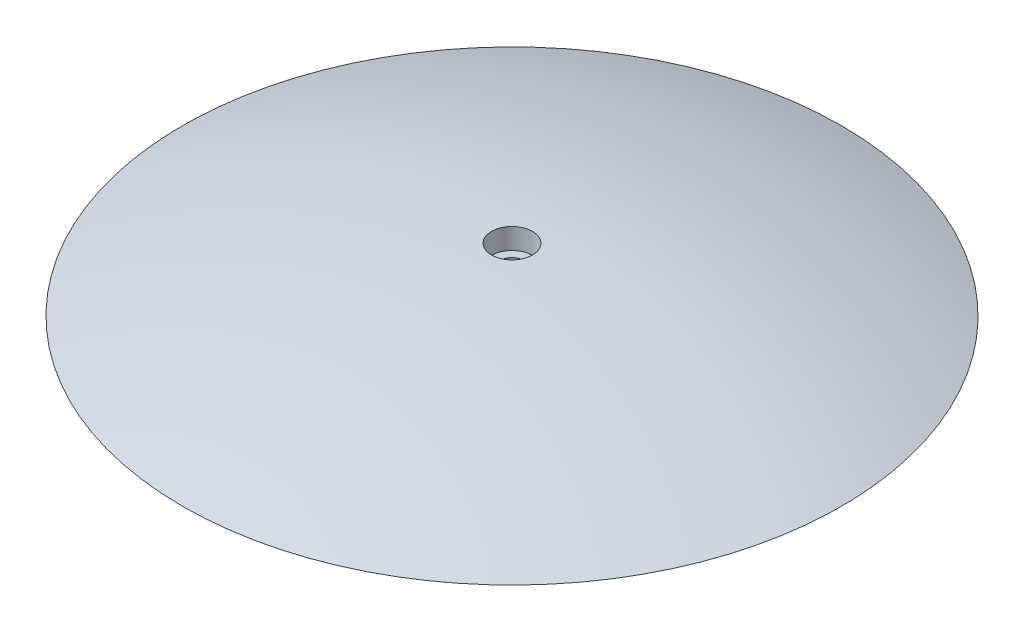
ISO-10303-21;
HEADER;
FILE_DESCRIPTION(('STEP AP214'),'2;1');
FILE_NAME('part.step','',(''),(''),'','','');
FILE_SCHEMA(('AUTOMOTIVE_DESIGN { 1 0 10303 214 1 1 1 1 }'));
ENDSEC;
DATA;
#1=APPLICATION_CONTEXT('core data for automotive mechanical design processes');
#2=APPLICATION_PROTOCOL_DEFINITION('international standard','automotive_design',2000,#1);
#3=PRODUCT_CONTEXT('',#1,'mechanical');
#4=PRODUCT('Part','Part','',(#3));
#5=PRODUCT_RELATED_PRODUCT_CATEGORY('part','',(#4));
#6=PRODUCT_DEFINITION_FORMATION('','',#4);
#7=PRODUCT_DEFINITION_CONTEXT('part definition',#1,'design');
#8=PRODUCT_DEFINITION('design','',#6,#7);
#9=PRODUCT_DEFINITION_SHAPE('','',#8);
#10=(LENGTH_UNIT() NAMED_UNIT(*) SI_UNIT(.MILLI.,.METRE.));
#11=(NAMED_UNIT(*) PLANE_ANGLE_UNIT() SI_UNIT($,.RADIAN.));
#12=(NAMED_UNIT(*) SI_UNIT($,.STERADIAN.) SOLID_ANGLE_UNIT());
#13=UNCERTAINTY_MEASURE_WITH_UNIT(LENGTH_MEASURE(1.E-05),#10,'distance_accuracy_value','');
#14=(GEOMETRIC_REPRESENTATION_CONTEXT(3) GLOBAL_UNCERTAINTY_ASSIGNED_CONTEXT((#13)) GLOBAL_UNIT_ASSIGNED_CONTEXT((#10,
#11,#12)) REPRESENTATION_CONTEXT('',''));
#15=CARTESIAN_POINT('',(0.,0.,0.));
#16=DIRECTION('',(0.,0.,1.));
#17=DIRECTION('',(1.,0.,0.));
#18=AXIS2_PLACEMENT_3D('',#15,#16,#17);
#19=CARTESIAN_POINT('',(0.,-41.2878564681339,0.));
#20=DIRECTION('',(0.,1.,0.));
#21=DIRECTION('',(0.,0.,1.));
#22=AXIS2_PLACEMENT_3D('',#19,#20,#21);
#23=DEGENERATE_TOROIDAL_SURFACE('',#22,0.302242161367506,44.3439990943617,.F.);
#24=CARTESIAN_POINT('',(0.,3.03742922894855,0.));
#25=DIRECTION('',(0.,1.,0.));
#26=DIRECTION('',(0.,0.,1.));
#27=AXIS2_PLACEMENT_3D('',#24,#25,#26);
#28=CIRCLE('',#27,0.985897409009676);
#29=CARTESIAN_POINT('',(0.,3.03742922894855,0.985897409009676));
#30=VERTEX_POINT('',#29);
#31=EDGE_CURVE('E10',#30,#30,#28,.T.);
#32=ORIENTED_EDGE('',*,*,#31,.F.);
#33=EDGE_LOOP('',(#32));
#34=FACE_BOUND('',#33,.T.);
#35=CARTESIAN_POINT('',(0.,0.,0.));
#36=DIRECTION('',(0.,1.,0.));
#37=DIRECTION('',(0.,0.,1.));
#38=AXIS2_PLACEMENT_3D('',#35,#36,#37);
#39=CIRCLE('',#38,15.875);
#40=CARTESIAN_POINT('',(0.,0.,15.875));
#41=VERTEX_POINT('',#40);
#42=EDGE_CURVE('E47',#41,#41,#39,.T.);
#43=ORIENTED_EDGE('',*,*,#42,.T.);
#44=EDGE_LOOP('',(#43));
#45=FACE_BOUND('',#44,.T.);
#46=ADVANCED_FACE('F28',(#34,#45),#23,.F.);
#47=CARTESIAN_POINT('',(0.,33.4003712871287,0.));
#48=DIRECTION('',(0.,1.,0.));
#49=DIRECTION('',(0.,0.,1.));
#50=AXIS2_PLACEMENT_3D('',#47,#48,#49);
#51=CYLINDRICAL_SURFACE('',#50,0.985897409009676);
#52=CARTESIAN_POINT('',(0.,2.03552212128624,0.));
#53=DIRECTION('',(0.,1.,0.));
#54=DIRECTION('',(0.,0.,1.));
#55=AXIS2_PLACEMENT_3D('',#52,#53,#54);
#56=CIRCLE('',#55,0.985897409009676);
#57=CARTESIAN_POINT('',(0.,2.03552212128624,0.985897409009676));
#58=VERTEX_POINT('',#57);
#59=EDGE_CURVE('E34',#58,#58,#56,.T.);
#60=ORIENTED_EDGE('',*,*,#59,.F.);
#61=EDGE_LOOP('',(#60));
#62=FACE_BOUND('',#61,.T.);
#63=ORIENTED_EDGE('',*,*,#31,.T.);
#64=EDGE_LOOP('',(#63));
#65=FACE_BOUND('',#64,.T.);
#66=ADVANCED_FACE('F66',(#62,#65),#51,.F.);
#67=CARTESIAN_POINT('',(0.985897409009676,2.03552212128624,0.));
#68=DIRECTION('',(0.,-1.,0.));
#69=DIRECTION('',(0.,0.,-1.));
#70=AXIS2_PLACEMENT_3D('',#67,#68,#69);
#71=PLANE('',#70);
#72=CARTESIAN_POINT('',(0.,2.03552212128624,0.));
#73=DIRECTION('',(0.,1.,0.));
#74=DIRECTION('',(0.,0.,1.));
#75=AXIS2_PLACEMENT_3D('',#72,#73,#74);
#76=CIRCLE('',#75,0.572486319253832);
#77=CARTESIAN_POINT('',(0.,2.03552212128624,0.572486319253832));
#78=VERTEX_POINT('',#77);
#79=EDGE_CURVE('E38',#78,#78,#76,.T.);
#80=ORIENTED_EDGE('',*,*,#79,.F.);
#81=EDGE_LOOP('',(#80));
#82=FACE_BOUND('',#81,.T.);
#83=ORIENTED_EDGE('',*,*,#59,.T.);
#84=EDGE_LOOP('',(#83));
#85=FACE_BOUND('',#84,.T.);
#86=ADVANCED_FACE('F61',(#82,#85),#71,.F.);
#87=CARTESIAN_POINT('',(0.,33.4003712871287,0.));
#88=DIRECTION('',(0.,1.,0.));
#89=DIRECTION('',(0.,0.,1.));
#90=AXIS2_PLACEMENT_3D('',#87,#88,#89);
#91=CYLINDRICAL_SURFACE('',#90,0.572486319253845);
#92=CARTESIAN_POINT('',(0.,0.,0.));
#93=DIRECTION('',(0.,1.,0.));
#94=DIRECTION('',(0.,0.,1.));
#95=AXIS2_PLACEMENT_3D('',#92,#93,#94);
#96=CIRCLE('',#95,0.572486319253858);
#97=CARTESIAN_POINT('',(0.,0.,0.572486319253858));
#98=VERTEX_POINT('',#97);
#99=EDGE_CURVE('E42',#98,#98,#96,.T.);
#100=ORIENTED_EDGE('',*,*,#99,.F.);
#101=EDGE_LOOP('',(#100));
#102=FACE_BOUND('',#101,.T.);
#103=ORIENTED_EDGE('',*,*,#79,.T.);
#104=EDGE_LOOP('',(#103));
#105=FACE_BOUND('',#104,.T.);
#106=ADVANCED_FACE('F55',(#102,#105),#91,.F.);
#107=CARTESIAN_POINT('',(0.572486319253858,0.,0.));
#108=DIRECTION('',(0.,1.,0.));
#109=DIRECTION('',(0.,0.,1.));
#110=AXIS2_PLACEMENT_3D('',#107,#108,#109);
#111=PLANE('',#110);
#112=ORIENTED_EDGE('',*,*,#42,.F.);
#113=EDGE_LOOP('',(#112));
#114=FACE_BOUND('',#113,.T.);
#115=ORIENTED_EDGE('',*,*,#99,.T.);
#116=EDGE_LOOP('',(#115));
#117=FACE_BOUND('',#116,.T.);
#118=ADVANCED_FACE('F52',(#114,#117),#111,.F.);
#119=CLOSED_SHELL('',(#46,#66,#86,#106,#118));
#120=MANIFOLD_SOLID_BREP('B2',#119);
#121=ADVANCED_BREP_SHAPE_REPRESENTATION('',(#18,#120),#14);
#122=SHAPE_DEFINITION_REPRESENTATION(#9,#121);
ENDSEC;
END-ISO-10303-21;
